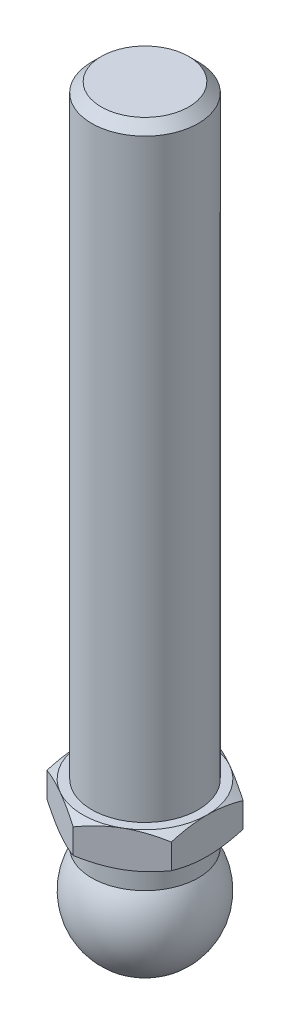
ISO-10303-21;
HEADER;
FILE_DESCRIPTION(('STEP AP214'),'2;1');
FILE_NAME('part.step','',(''),(''),'','','');
FILE_SCHEMA(('AUTOMOTIVE_DESIGN { 1 0 10303 214 1 1 1 1 }'));
ENDSEC;
DATA;
#1=APPLICATION_CONTEXT('core data for automotive mechanical design processes');
#2=APPLICATION_PROTOCOL_DEFINITION('international standard','automotive_design',2000,#1);
#3=PRODUCT_CONTEXT('',#1,'mechanical');
#4=PRODUCT('Part','Part','',(#3));
#5=PRODUCT_RELATED_PRODUCT_CATEGORY('part','',(#4));
#6=PRODUCT_DEFINITION_FORMATION('','',#4);
#7=PRODUCT_DEFINITION_CONTEXT('part definition',#1,'design');
#8=PRODUCT_DEFINITION('design','',#6,#7);
#9=PRODUCT_DEFINITION_SHAPE('','',#8);
#10=(LENGTH_UNIT() NAMED_UNIT(*) SI_UNIT(.MILLI.,.METRE.));
#11=(NAMED_UNIT(*) PLANE_ANGLE_UNIT() SI_UNIT($,.RADIAN.));
#12=(NAMED_UNIT(*) SI_UNIT($,.STERADIAN.) SOLID_ANGLE_UNIT());
#13=UNCERTAINTY_MEASURE_WITH_UNIT(LENGTH_MEASURE(1.E-05),#10,'distance_accuracy_value','');
#14=(GEOMETRIC_REPRESENTATION_CONTEXT(3) GLOBAL_UNCERTAINTY_ASSIGNED_CONTEXT((#13)) GLOBAL_UNIT_ASSIGNED_CONTEXT((#10,
#11,#12)) REPRESENTATION_CONTEXT('',''));
#15=CARTESIAN_POINT('',(0.,0.,0.));
#16=DIRECTION('',(0.,0.,1.));
#17=DIRECTION('',(1.,0.,0.));
#18=AXIS2_PLACEMENT_3D('',#15,#16,#17);
#19=CARTESIAN_POINT('',(0.,10.85,0.));
#20=DIRECTION('',(0.,-1.,0.));
#21=DIRECTION('',(0.,0.,-1.));
#22=AXIS2_PLACEMENT_3D('',#19,#20,#21);
#23=CONICAL_SURFACE('',#22,7.,1.0471975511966);
#24=CARTESIAN_POINT('',(-7.,6.78828268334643,12.1648696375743));
#25=CARTESIAN_POINT('',(-7.,6.93391573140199,11.8738003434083));
#26=CARTESIAN_POINT('',(-7.,7.07854589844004,11.5822239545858));
#27=CARTESIAN_POINT('',(-7.,7.36531569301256,10.997825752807));
#28=CARTESIAN_POINT('',(-7.,7.50745515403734,10.7050038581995));
#29=CARTESIAN_POINT('',(-7.,7.78902214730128,10.117331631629));
#30=CARTESIAN_POINT('',(-7.,7.92844364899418,9.82247840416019));
#31=CARTESIAN_POINT('',(-7.,8.20360604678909,9.2310632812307));
#32=CARTESIAN_POINT('',(-7.,8.33934701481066,8.9345014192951));
#33=CARTESIAN_POINT('',(-7.,8.61231104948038,8.325935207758));
#34=CARTESIAN_POINT('',(-7.,8.74932547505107,8.01383696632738));
#35=CARTESIAN_POINT('',(-7.,9.01713837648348,7.38695797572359));
#36=CARTESIAN_POINT('',(-7.,9.14793657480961,7.07217710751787));
#37=CARTESIAN_POINT('',(-7.,9.40155301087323,6.43962449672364));
#38=CARTESIAN_POINT('',(-7.,9.524376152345,6.12185473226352));
#39=CARTESIAN_POINT('',(-7.,9.7599016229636,5.48260317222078));
#40=CARTESIAN_POINT('',(-7.,9.87260505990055,5.16112178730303));
#41=CARTESIAN_POINT('',(-7.,10.1099014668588,4.43821731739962));
#42=CARTESIAN_POINT('',(-7.,10.231118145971,4.03566892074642));
#43=CARTESIAN_POINT('',(-7.,10.4469740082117,3.22331060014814));
#44=CARTESIAN_POINT('',(-7.,10.5416155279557,2.81350131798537));
#45=CARTESIAN_POINT('',(-7.,10.6569999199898,2.19742561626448));
#46=CARTESIAN_POINT('',(-7.,10.6908518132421,1.99359214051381));
#47=CARTESIAN_POINT('',(-7.,10.7493191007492,1.58461613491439));
#48=CARTESIAN_POINT('',(-7.,10.7739358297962,1.37947379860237));
#49=CARTESIAN_POINT('',(-7.,10.8131968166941,0.968289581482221));
#50=CARTESIAN_POINT('',(-7.,10.8278439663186,0.762247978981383));
#51=CARTESIAN_POINT('',(-7.,10.8467021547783,0.349683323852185));
#52=CARTESIAN_POINT('',(-7.,10.8509132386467,0.143160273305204));
#53=CARTESIAN_POINT('',(-7.,10.8487493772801,-0.27108276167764));
#54=CARTESIAN_POINT('',(-7.,10.8423100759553,-0.478802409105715));
#55=CARTESIAN_POINT('',(-7.,10.8189433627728,-0.893645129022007));
#56=CARTESIAN_POINT('',(-7.,10.8020159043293,-1.10076819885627));
#57=CARTESIAN_POINT('',(-7.,10.7582124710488,-1.51403043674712));
#58=CARTESIAN_POINT('',(-7.,10.7313327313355,-1.7201692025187));
#59=CARTESIAN_POINT('',(-7.,10.6684180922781,-2.13103319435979));
#60=CARTESIAN_POINT('',(-7.,10.6323828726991,-2.33575837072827));
#61=CARTESIAN_POINT('',(-7.,10.5105686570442,-2.95437912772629));
#62=CARTESIAN_POINT('',(-7.,10.4118729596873,-3.36575077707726));
#63=CARTESIAN_POINT('',(-7.,10.1884533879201,-4.18138012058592));
#64=CARTESIAN_POINT('',(-7.,10.0637148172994,-4.58563365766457));
#65=CARTESIAN_POINT('',(-7.,9.82332483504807,-5.30320893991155));
#66=CARTESIAN_POINT('',(-7.,9.71128759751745,-5.61775957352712));
#67=CARTESIAN_POINT('',(-7.,9.47785144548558,-6.24325021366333));
#68=CARTESIAN_POINT('',(-7.,9.35645511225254,-6.55419118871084));
#69=CARTESIAN_POINT('',(-7.,9.1062070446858,-7.17328528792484));
#70=CARTESIAN_POINT('',(-7.,8.97735033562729,-7.48143638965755));
#71=CARTESIAN_POINT('',(-7.,8.71378231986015,-8.09523802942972));
#72=CARTESIAN_POINT('',(-7.,8.57907065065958,-8.40088841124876));
#73=CARTESIAN_POINT('',(-7.,8.31078407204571,-8.99716345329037));
#74=CARTESIAN_POINT('',(-7.,8.17740317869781,-9.28787568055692));
#75=CARTESIAN_POINT('',(-7.,7.90714715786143,-9.86766295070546));
#76=CARTESIAN_POINT('',(-7.,7.77027208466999,-10.1567380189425));
#77=CARTESIAN_POINT('',(-7.,7.49389786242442,-10.7329937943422));
#78=CARTESIAN_POINT('',(-7.,7.35440383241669,-11.0201769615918));
#79=CARTESIAN_POINT('',(-7.,7.07302286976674,-11.5933594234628));
#80=CARTESIAN_POINT('',(-7.,6.93113600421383,-11.879358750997));
#81=CARTESIAN_POINT('',(-7.,6.78828268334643,-12.1648696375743));
#82=B_SPLINE_CURVE_WITH_KNOTS('',3,(#24,#25,#26,#27,#28,#29,#30,#31,#32,#33,#34,#35,#36,#37,#38,
#39,#40,#41,#42,#43,#44,#45,#46,#47,#48,#49,#50,#51,#52,#53,#54,#55,#56,#57,#58,#59,#60,#61,#62,
#63,#64,#65,#66,#67,#68,#69,#70,#71,#72,#73,#74,#75,#76,#77,#78,#79,#80,#81),.UNSPECIFIED.,.F.,
.F.,(4,2,2,2,2,2,2,2,2,2,2,2,2,2,2,2,2,2,2,2,2,2,2,2,2,2,2,2,4),(0.,0.976413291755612,
1.95289161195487,2.93133423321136,3.90975772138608,4.93225217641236,5.95479223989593,
6.9766974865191,7.9984907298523,9.25906449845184,10.5195273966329,11.1392271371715,
11.7588372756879,12.3782676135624,12.9976952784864,13.6208795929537,14.2440666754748,
14.8674897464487,15.490934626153,16.758797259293,18.027377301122,19.0289263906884,
20.0302002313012,21.0321496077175,22.0341611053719,22.9936838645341,23.9531917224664,
24.9109871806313,25.8687558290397),.UNSPECIFIED.);
#83=CARTESIAN_POINT('',(-7.,10.2247852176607,4.04145188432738));
#84=VERTEX_POINT('',#83);
#85=CARTESIAN_POINT('',(-7.,10.85,0.));
#86=VERTEX_POINT('',#85);
#87=EDGE_CURVE('E316',#84,#86,#82,.T.);
#88=ORIENTED_EDGE('',*,*,#87,.F.);
#89=CARTESIAN_POINT('',(0.00020000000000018,10.2247185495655,8.0830192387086));
#90=CARTESIAN_POINT('',(-0.153667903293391,10.2760001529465,7.99418356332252));
#91=CARTESIAN_POINT('',(-0.30810950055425,10.3249544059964,7.90501666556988));
#92=CARTESIAN_POINT('',(-0.618246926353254,10.4175672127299,7.72595873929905));
#93=CARTESIAN_POINT('',(-0.773943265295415,10.4612234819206,7.63606741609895));
#94=CARTESIAN_POINT('',(-1.24352516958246,10.5833884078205,7.36495417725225));
#95=CARTESIAN_POINT('',(-1.5592643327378,10.652874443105,7.18266208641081));
#96=CARTESIAN_POINT('',(-2.03176224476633,10.7343550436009,6.9098652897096));
#97=CARTESIAN_POINT('',(-2.18710922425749,10.7575665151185,6.82017566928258));
#98=CARTESIAN_POINT('',(-2.49850511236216,10.7964887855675,6.64039116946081));
#99=CARTESIAN_POINT('',(-2.65455395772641,10.8122002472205,6.55029632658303));
#100=CARTESIAN_POINT('',(-2.96692267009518,10.8357220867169,6.36995016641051));
#101=CARTESIAN_POINT('',(-3.12324202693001,10.8435414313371,6.27969914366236));
#102=CARTESIAN_POINT('',(-3.43601650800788,10.8511197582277,6.09911871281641));
#103=CARTESIAN_POINT('',(-3.59247162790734,10.850878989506,6.00878930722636));
#104=CARTESIAN_POINT('',(-4.02110687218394,10.8391402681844,5.76131663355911));
#105=CARTESIAN_POINT('',(-4.2931466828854,10.8194342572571,5.60425437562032));
#106=CARTESIAN_POINT('',(-4.8354194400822,10.7569465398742,5.29117305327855));
#107=CARTESIAN_POINT('',(-5.10565047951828,10.714143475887,5.13515508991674));
#108=CARTESIAN_POINT('',(-5.64901454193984,10.6071483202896,4.82144370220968));
#109=CARTESIAN_POINT('',(-5.92207900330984,10.5425029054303,4.66378986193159));
#110=CARTESIAN_POINT('',(-6.46413578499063,10.395783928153,4.35083323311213));
#111=CARTESIAN_POINT('',(-6.73313504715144,10.3137448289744,4.19552643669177));
#112=CARTESIAN_POINT('',(-7.0002,10.2247185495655,4.04133641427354));
#113=B_SPLINE_CURVE_WITH_KNOTS('',3,(#89,#90,#91,#92,#93,#94,#95,#96,#97,#98,#99,#100,#101,#102,
#103,#104,#105,#106,#107,#108,#109,#110,#111,#112),.UNSPECIFIED.,.F.,.F.,(4,2,2,2,2,2,2,2,2,2,2,
4),(0.,0.554727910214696,1.10969417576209,2.2219327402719,2.76443041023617,3.30688013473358,
3.8487128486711,4.3905288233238,5.33376515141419,6.27787517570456,7.2429241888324,
8.20607866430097),.UNSPECIFIED.);
#114=CARTESIAN_POINT('',(-3.5,10.85,6.06217782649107));
#115=VERTEX_POINT('',#114);
#116=EDGE_CURVE('E138',#115,#84,#113,.T.);
#117=ORIENTED_EDGE('',*,*,#116,.F.);
#118=CARTESIAN_POINT('',(0.,10.85,0.));
#119=DIRECTION('',(0.,-1.,0.));
#120=DIRECTION('',(0.,0.,-1.));
#121=AXIS2_PLACEMENT_3D('',#118,#119,#120);
#122=CIRCLE('',#121,7.);
#123=EDGE_CURVE('E286',#115,#86,#122,.T.);
#124=ORIENTED_EDGE('',*,*,#123,.T.);
#125=EDGE_LOOP('',(#88,#117,#124));
#126=FACE_BOUND('',#125,.T.);
#127=ADVANCED_FACE('F17',(#126),#23,.T.);
#128=CARTESIAN_POINT('',(-7.,10.2247852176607,-4.04145188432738));
#129=VERTEX_POINT('',#128);
#130=EDGE_CURVE('E196',#86,#129,#82,.T.);
#131=ORIENTED_EDGE('',*,*,#130,.F.);
#132=CARTESIAN_POINT('',(-3.5,10.85,-6.06217782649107));
#133=VERTEX_POINT('',#132);
#134=EDGE_CURVE('E198',#86,#133,#122,.T.);
#135=ORIENTED_EDGE('',*,*,#134,.T.);
#136=CARTESIAN_POINT('',(-7.0002,10.2247185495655,-4.04133641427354));
#137=CARTESIAN_POINT('',(-6.84633209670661,10.2760001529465,-4.13017208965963));
#138=CARTESIAN_POINT('',(-6.69189049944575,10.3249544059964,-4.21933898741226));
#139=CARTESIAN_POINT('',(-6.38175307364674,10.4175672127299,-4.39839691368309));
#140=CARTESIAN_POINT('',(-6.22605673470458,10.4612234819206,-4.48828823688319));
#141=CARTESIAN_POINT('',(-5.75647483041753,10.5833884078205,-4.75940147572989));
#142=CARTESIAN_POINT('',(-5.4407356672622,10.652874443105,-4.94169356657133));
#143=CARTESIAN_POINT('',(-4.96823775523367,10.7343550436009,-5.21449036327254));
#144=CARTESIAN_POINT('',(-4.81289077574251,10.7575665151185,-5.30417998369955));
#145=CARTESIAN_POINT('',(-4.50149488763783,10.7964887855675,-5.48396448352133));
#146=CARTESIAN_POINT('',(-4.34544604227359,10.8122002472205,-5.57405932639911));
#147=CARTESIAN_POINT('',(-4.03307732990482,10.8357220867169,-5.75440548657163));
#148=CARTESIAN_POINT('',(-3.87675797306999,10.8435414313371,-5.84465650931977));
#149=CARTESIAN_POINT('',(-3.56398349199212,10.8511197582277,-6.02523694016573));
#150=CARTESIAN_POINT('',(-3.40752837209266,10.850878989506,-6.11556634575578));
#151=CARTESIAN_POINT('',(-2.97889312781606,10.8391402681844,-6.36303901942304));
#152=CARTESIAN_POINT('',(-2.7068533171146,10.8194342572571,-6.52010127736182));
#153=CARTESIAN_POINT('',(-2.1645805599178,10.7569465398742,-6.83318259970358));
#154=CARTESIAN_POINT('',(-1.89434952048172,10.714143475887,-6.9892005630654));
#155=CARTESIAN_POINT('',(-1.35098545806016,10.6071483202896,-7.30291195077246));
#156=CARTESIAN_POINT('',(-1.07792099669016,10.5425029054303,-7.46056579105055));
#157=CARTESIAN_POINT('',(-0.53586421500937,10.395783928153,-7.77352241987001));
#158=CARTESIAN_POINT('',(-0.266864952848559,10.3137448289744,-7.92882921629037));
#159=CARTESIAN_POINT('',(0.000200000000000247,10.2247185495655,-8.0830192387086));
#160=B_SPLINE_CURVE_WITH_KNOTS('',3,(#136,#137,#138,#139,#140,#141,#142,#143,#144,#145,#146,
#147,#148,#149,#150,#151,#152,#153,#154,#155,#156,#157,#158,#159),.UNSPECIFIED.,.F.,.F.,(4,2,2,
2,2,2,2,2,2,2,2,4),(0.,0.554727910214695,1.10969417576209,2.2219327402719,2.76443041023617,
3.30688013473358,3.8487128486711,4.39052882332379,5.33376515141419,6.27787517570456,
7.2429241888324,8.20607866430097),.UNSPECIFIED.);
#161=EDGE_CURVE('E186',#129,#133,#160,.T.);
#162=ORIENTED_EDGE('',*,*,#161,.F.);
#163=EDGE_LOOP('',(#131,#135,#162));
#164=FACE_BOUND('',#163,.T.);
#165=ADVANCED_FACE('F195',(#164),#23,.T.);
#166=CARTESIAN_POINT('',(0.,10.2247852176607,-8.08290376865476));
#167=VERTEX_POINT('',#166);
#168=EDGE_CURVE('E200',#133,#167,#160,.T.);
#169=ORIENTED_EDGE('',*,*,#168,.F.);
#170=CARTESIAN_POINT('',(3.5,10.85,-6.06217782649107));
#171=VERTEX_POINT('',#170);
#172=EDGE_CURVE('E296',#133,#171,#122,.T.);
#173=ORIENTED_EDGE('',*,*,#172,.T.);
#174=CARTESIAN_POINT('',(-0.00020000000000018,10.2247185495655,-8.0830192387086));
#175=CARTESIAN_POINT('',(0.153667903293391,10.2760001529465,-7.99418356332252));
#176=CARTESIAN_POINT('',(0.30810950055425,10.3249544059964,-7.90501666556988));
#177=CARTESIAN_POINT('',(0.618246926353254,10.4175672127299,-7.72595873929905));
#178=CARTESIAN_POINT('',(0.773943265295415,10.4612234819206,-7.63606741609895));
#179=CARTESIAN_POINT('',(1.24352516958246,10.5833884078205,-7.36495417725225));
#180=CARTESIAN_POINT('',(1.5592643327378,10.652874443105,-7.18266208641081));
#181=CARTESIAN_POINT('',(2.03176224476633,10.7343550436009,-6.9098652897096));
#182=CARTESIAN_POINT('',(2.18710922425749,10.7575665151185,-6.82017566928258));
#183=CARTESIAN_POINT('',(2.49850511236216,10.7964887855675,-6.64039116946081));
#184=CARTESIAN_POINT('',(2.65455395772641,10.8122002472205,-6.55029632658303));
#185=CARTESIAN_POINT('',(2.96692267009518,10.8357220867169,-6.36995016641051));
#186=CARTESIAN_POINT('',(3.12324202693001,10.8435414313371,-6.27969914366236));
#187=CARTESIAN_POINT('',(3.43601650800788,10.8511197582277,-6.09911871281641));
#188=CARTESIAN_POINT('',(3.59247162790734,10.850878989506,-6.00878930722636));
#189=CARTESIAN_POINT('',(4.02110687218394,10.8391402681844,-5.76131663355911));
#190=CARTESIAN_POINT('',(4.2931466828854,10.8194342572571,-5.60425437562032));
#191=CARTESIAN_POINT('',(4.8354194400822,10.7569465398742,-5.29117305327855));
#192=CARTESIAN_POINT('',(5.10565047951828,10.714143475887,-5.13515508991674));
#193=CARTESIAN_POINT('',(5.64901454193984,10.6071483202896,-4.82144370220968));
#194=CARTESIAN_POINT('',(5.92207900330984,10.5425029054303,-4.66378986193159));
#195=CARTESIAN_POINT('',(6.46413578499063,10.395783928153,-4.35083323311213));
#196=CARTESIAN_POINT('',(6.73313504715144,10.3137448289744,-4.19552643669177));
#197=CARTESIAN_POINT('',(7.0002,10.2247185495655,-4.04133641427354));
#198=B_SPLINE_CURVE_WITH_KNOTS('',3,(#174,#175,#176,#177,#178,#179,#180,#181,#182,#183,#184,
#185,#186,#187,#188,#189,#190,#191,#192,#193,#194,#195,#196,#197),.UNSPECIFIED.,.F.,.F.,(4,2,2,
2,2,2,2,2,2,2,2,4),(0.,0.554727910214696,1.10969417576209,2.2219327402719,2.76443041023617,
3.30688013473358,3.8487128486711,4.3905288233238,5.33376515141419,6.27787517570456,
7.2429241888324,8.20607866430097),.UNSPECIFIED.);
#199=EDGE_CURVE('E246',#167,#171,#198,.T.);
#200=ORIENTED_EDGE('',*,*,#199,.F.);
#201=EDGE_LOOP('',(#169,#173,#200));
#202=FACE_BOUND('',#201,.T.);
#203=ADVANCED_FACE('F349',(#202),#23,.T.);
#204=CARTESIAN_POINT('',(7.,10.2247852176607,-4.04145188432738));
#205=VERTEX_POINT('',#204);
#206=EDGE_CURVE('E241',#171,#205,#198,.T.);
#207=ORIENTED_EDGE('',*,*,#206,.F.);
#208=CARTESIAN_POINT('',(7.,10.85,0.));
#209=VERTEX_POINT('',#208);
#210=EDGE_CURVE('E291',#171,#209,#122,.T.);
#211=ORIENTED_EDGE('',*,*,#210,.T.);
#212=CARTESIAN_POINT('',(7.,6.78828268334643,-12.1648696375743));
#213=CARTESIAN_POINT('',(7.,6.93391573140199,-11.8738003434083));
#214=CARTESIAN_POINT('',(7.,7.07854589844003,-11.5822239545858));
#215=CARTESIAN_POINT('',(7.,7.36531569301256,-10.997825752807));
#216=CARTESIAN_POINT('',(7.,7.50745515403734,-10.7050038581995));
#217=CARTESIAN_POINT('',(7.,7.78902214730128,-10.117331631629));
#218=CARTESIAN_POINT('',(7.,7.92844364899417,-9.82247840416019));
#219=CARTESIAN_POINT('',(7.,8.20360604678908,-9.23106328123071));
#220=CARTESIAN_POINT('',(7.,8.33934701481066,-8.9345014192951));
#221=CARTESIAN_POINT('',(7.,8.61231104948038,-8.325935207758));
#222=CARTESIAN_POINT('',(7.,8.74932547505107,-8.01383696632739));
#223=CARTESIAN_POINT('',(7.,9.01713837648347,-7.3869579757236));
#224=CARTESIAN_POINT('',(7.,9.1479365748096,-7.07217710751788));
#225=CARTESIAN_POINT('',(7.,9.40155301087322,-6.43962449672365));
#226=CARTESIAN_POINT('',(7.,9.52437615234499,-6.12185473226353));
#227=CARTESIAN_POINT('',(7.,9.7599016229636,-5.48260317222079));
#228=CARTESIAN_POINT('',(7.,9.87260505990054,-5.16112178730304));
#229=CARTESIAN_POINT('',(7.,10.1099014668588,-4.43821731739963));
#230=CARTESIAN_POINT('',(7.,10.231118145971,-4.03566892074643));
#231=CARTESIAN_POINT('',(7.,10.4469740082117,-3.22331060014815));
#232=CARTESIAN_POINT('',(7.,10.5416155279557,-2.81350131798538));
#233=CARTESIAN_POINT('',(7.,10.6569999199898,-2.19742561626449));
#234=CARTESIAN_POINT('',(7.,10.6908518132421,-1.99359214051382));
#235=CARTESIAN_POINT('',(7.,10.7493191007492,-1.5846161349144));
#236=CARTESIAN_POINT('',(7.,10.7739358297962,-1.37947379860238));
#237=CARTESIAN_POINT('',(7.,10.8131968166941,-0.968289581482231));
#238=CARTESIAN_POINT('',(7.,10.8278439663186,-0.762247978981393));
#239=CARTESIAN_POINT('',(7.,10.8467021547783,-0.349683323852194));
#240=CARTESIAN_POINT('',(7.,10.8509132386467,-0.143160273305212));
#241=CARTESIAN_POINT('',(7.,10.8487493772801,0.271082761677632));
#242=CARTESIAN_POINT('',(7.,10.8423100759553,0.478802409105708));
#243=CARTESIAN_POINT('',(7.,10.8189433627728,0.893645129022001));
#244=CARTESIAN_POINT('',(7.,10.8020159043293,1.10076819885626));
#245=CARTESIAN_POINT('',(7.,10.7582124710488,1.51403043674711));
#246=CARTESIAN_POINT('',(7.,10.7313327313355,1.72016920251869));
#247=CARTESIAN_POINT('',(7.,10.6684180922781,2.13103319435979));
#248=CARTESIAN_POINT('',(7.,10.6323828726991,2.33575837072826));
#249=CARTESIAN_POINT('',(7.,10.5105686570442,2.95437912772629));
#250=CARTESIAN_POINT('',(7.,10.4118729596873,3.36575077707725));
#251=CARTESIAN_POINT('',(7.,10.1884533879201,4.18138012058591));
#252=CARTESIAN_POINT('',(7.,10.0637148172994,4.58563365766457));
#253=CARTESIAN_POINT('',(7.,9.82332483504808,5.30320893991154));
#254=CARTESIAN_POINT('',(7.,9.71128759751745,5.61775957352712));
#255=CARTESIAN_POINT('',(7.,9.47785144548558,6.24325021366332));
#256=CARTESIAN_POINT('',(7.,9.35645511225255,6.55419118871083));
#257=CARTESIAN_POINT('',(7.,9.1062070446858,7.17328528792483));
#258=CARTESIAN_POINT('',(7.,8.9773503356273,7.48143638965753));
#259=CARTESIAN_POINT('',(7.,8.71378231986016,8.09523802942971));
#260=CARTESIAN_POINT('',(7.,8.57907065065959,8.40088841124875));
#261=CARTESIAN_POINT('',(7.,8.31078407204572,8.99716345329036));
#262=CARTESIAN_POINT('',(7.,8.17740317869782,9.2878756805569));
#263=CARTESIAN_POINT('',(7.,7.90714715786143,9.86766295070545));
#264=CARTESIAN_POINT('',(7.,7.77027208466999,10.1567380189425));
#265=CARTESIAN_POINT('',(7.,7.49389786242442,10.7329937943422));
#266=CARTESIAN_POINT('',(7.,7.35440383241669,11.0201769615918));
#267=CARTESIAN_POINT('',(7.,7.07302286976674,11.5933594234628));
#268=CARTESIAN_POINT('',(7.,6.93113600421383,11.879358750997));
#269=CARTESIAN_POINT('',(7.,6.78828268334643,12.1648696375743));
#270=B_SPLINE_CURVE_WITH_KNOTS('',3,(#212,#213,#214,#215,#216,#217,#218,#219,#220,#221,#222,
#223,#224,#225,#226,#227,#228,#229,#230,#231,#232,#233,#234,#235,#236,#237,#238,#239,#240,#241,
#242,#243,#244,#245,#246,#247,#248,#249,#250,#251,#252,#253,#254,#255,#256,#257,#258,#259,#260,
#261,#262,#263,#264,#265,#266,#267,#268,#269),.UNSPECIFIED.,.F.,.F.,(4,2,2,2,2,2,2,2,2,2,2,2,2,
2,2,2,2,2,2,2,2,2,2,2,2,2,2,2,4),(0.,0.976413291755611,1.95289161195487,2.93133423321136,
3.90975772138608,4.93225217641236,5.95479223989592,6.97669748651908,7.99849072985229,
9.25906449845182,10.5195273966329,11.1392271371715,11.7588372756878,12.3782676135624,
12.9976952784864,13.6208795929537,14.2440666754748,14.8674897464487,15.490934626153,
16.758797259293,18.027377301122,19.0289263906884,20.0302002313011,21.0321496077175,
22.0341611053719,22.9936838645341,23.9531917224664,24.9109871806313,25.8687558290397),.UNSPECIFIED.);
#271=EDGE_CURVE('E252',#205,#209,#270,.T.);
#272=ORIENTED_EDGE('',*,*,#271,.F.);
#273=EDGE_LOOP('',(#207,#211,#272));
#274=FACE_BOUND('',#273,.T.);
#275=ADVANCED_FACE('F359',(#274),#23,.T.);
#276=CARTESIAN_POINT('',(7.,10.2247852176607,4.04145188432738));
#277=VERTEX_POINT('',#276);
#278=EDGE_CURVE('E254',#209,#277,#270,.T.);
#279=ORIENTED_EDGE('',*,*,#278,.F.);
#280=CARTESIAN_POINT('',(3.5,10.85,6.06217782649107));
#281=VERTEX_POINT('',#280);
#282=EDGE_CURVE('E284',#209,#281,#122,.T.);
#283=ORIENTED_EDGE('',*,*,#282,.T.);
#284=CARTESIAN_POINT('',(7.0002,10.2247185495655,4.04133641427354));
#285=CARTESIAN_POINT('',(6.84633209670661,10.2760001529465,4.13017208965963));
#286=CARTESIAN_POINT('',(6.69189049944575,10.3249544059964,4.21933898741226));
#287=CARTESIAN_POINT('',(6.38175307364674,10.4175672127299,4.39839691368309));
#288=CARTESIAN_POINT('',(6.22605673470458,10.4612234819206,4.48828823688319));
#289=CARTESIAN_POINT('',(5.75647483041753,10.5833884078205,4.75940147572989));
#290=CARTESIAN_POINT('',(5.4407356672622,10.652874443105,4.94169356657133));
#291=CARTESIAN_POINT('',(4.96823775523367,10.7343550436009,5.21449036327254));
#292=CARTESIAN_POINT('',(4.81289077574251,10.7575665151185,5.30417998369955));
#293=CARTESIAN_POINT('',(4.50149488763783,10.7964887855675,5.48396448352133));
#294=CARTESIAN_POINT('',(4.34544604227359,10.8122002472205,5.57405932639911));
#295=CARTESIAN_POINT('',(4.03307732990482,10.8357220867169,5.75440548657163));
#296=CARTESIAN_POINT('',(3.87675797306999,10.8435414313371,5.84465650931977));
#297=CARTESIAN_POINT('',(3.56398349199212,10.8511197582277,6.02523694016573));
#298=CARTESIAN_POINT('',(3.40752837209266,10.850878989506,6.11556634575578));
#299=CARTESIAN_POINT('',(2.97889312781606,10.8391402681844,6.36303901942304));
#300=CARTESIAN_POINT('',(2.7068533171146,10.8194342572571,6.52010127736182));
#301=CARTESIAN_POINT('',(2.1645805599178,10.7569465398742,6.83318259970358));
#302=CARTESIAN_POINT('',(1.89434952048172,10.714143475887,6.9892005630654));
#303=CARTESIAN_POINT('',(1.35098545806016,10.6071483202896,7.30291195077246));
#304=CARTESIAN_POINT('',(1.07792099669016,10.5425029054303,7.46056579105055));
#305=CARTESIAN_POINT('',(0.53586421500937,10.395783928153,7.77352241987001));
#306=CARTESIAN_POINT('',(0.266864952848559,10.3137448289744,7.92882921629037));
#307=CARTESIAN_POINT('',(-0.000200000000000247,10.2247185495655,8.0830192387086));
#308=B_SPLINE_CURVE_WITH_KNOTS('',3,(#284,#285,#286,#287,#288,#289,#290,#291,#292,#293,#294,
#295,#296,#297,#298,#299,#300,#301,#302,#303,#304,#305,#306,#307),.UNSPECIFIED.,.F.,.F.,(4,2,2,
2,2,2,2,2,2,2,2,4),(0.,0.554727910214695,1.10969417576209,2.2219327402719,2.76443041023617,
3.30688013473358,3.8487128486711,4.39052882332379,5.33376515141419,6.27787517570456,
7.2429241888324,8.20607866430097),.UNSPECIFIED.);
#309=EDGE_CURVE('E129',#277,#281,#308,.T.);
#310=ORIENTED_EDGE('',*,*,#309,.F.);
#311=EDGE_LOOP('',(#279,#283,#310));
#312=FACE_BOUND('',#311,.T.);
#313=ADVANCED_FACE('F288',(#312),#23,.T.);
#314=CARTESIAN_POINT('',(0.,10.2247852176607,8.08290376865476));
#315=VERTEX_POINT('',#314);
#316=EDGE_CURVE('E119',#281,#315,#308,.T.);
#317=ORIENTED_EDGE('',*,*,#316,.F.);
#318=EDGE_CURVE('E277',#281,#115,#122,.T.);
#319=ORIENTED_EDGE('',*,*,#318,.T.);
#320=EDGE_CURVE('E32',#315,#115,#113,.T.);
#321=ORIENTED_EDGE('',*,*,#320,.F.);
#322=EDGE_LOOP('',(#317,#319,#321));
#323=FACE_BOUND('',#322,.T.);
#324=ADVANCED_FACE('F276',(#323),#23,.T.);
#325=CARTESIAN_POINT('',(0.,78.85,0.));
#326=DIRECTION('',(0.,-1.,0.));
#327=DIRECTION('',(0.,0.,-1.));
#328=AXIS2_PLACEMENT_3D('',#325,#326,#327);
#329=PLANE('',#328);
#330=CARTESIAN_POINT('',(0.,78.85,0.));
#331=DIRECTION('',(0.,-1.,0.));
#332=DIRECTION('',(0.,0.,-1.));
#333=AXIS2_PLACEMENT_3D('',#330,#331,#332);
#334=CIRCLE('',#333,4.9265);
#335=CARTESIAN_POINT('',(0.,78.85,-4.9265));
#336=VERTEX_POINT('',#335);
#337=EDGE_CURVE('E25',#336,#336,#334,.T.);
#338=ORIENTED_EDGE('',*,*,#337,.F.);
#339=EDGE_LOOP('',(#338));
#340=FACE_BOUND('',#339,.T.);
#341=ADVANCED_FACE('F19',(#340),#329,.F.);
#342=CARTESIAN_POINT('',(0.,78.85,0.));
#343=DIRECTION('',(0.,-1.,0.));
#344=DIRECTION('',(0.,0.,-1.));
#345=AXIS2_PLACEMENT_3D('',#342,#343,#344);
#346=CONICAL_SURFACE('',#345,4.9265,0.785398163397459);
#347=CARTESIAN_POINT('',(0.,77.7765,0.));
#348=DIRECTION('',(0.,-1.,0.));
#349=DIRECTION('',(0.,0.,-1.));
#350=AXIS2_PLACEMENT_3D('',#347,#348,#349);
#351=CIRCLE('',#350,6.);
#352=CARTESIAN_POINT('',(0.,77.7765,-6.));
#353=VERTEX_POINT('',#352);
#354=EDGE_CURVE('E293',#353,#353,#351,.T.);
#355=ORIENTED_EDGE('',*,*,#354,.F.);
#356=EDGE_LOOP('',(#355));
#357=FACE_BOUND('',#356,.T.);
#358=ORIENTED_EDGE('',*,*,#337,.T.);
#359=EDGE_LOOP('',(#358));
#360=FACE_BOUND('',#359,.T.);
#361=ADVANCED_FACE('F357',(#357,#360),#346,.T.);
#362=CARTESIAN_POINT('',(0.,-7.,0.));
#363=DIRECTION('',(0.,-1.,0.));
#364=DIRECTION('',(0.,0.,-1.));
#365=AXIS2_PLACEMENT_3D('',#362,#363,#364);
#366=CYLINDRICAL_SURFACE('',#365,6.);
#367=CARTESIAN_POINT('',(0.,10.85,0.));
#368=DIRECTION('',(0.,-1.,0.));
#369=DIRECTION('',(0.,0.,-1.));
#370=AXIS2_PLACEMENT_3D('',#367,#368,#369);
#371=CIRCLE('',#370,6.);
#372=CARTESIAN_POINT('',(0.,10.85,-6.));
#373=VERTEX_POINT('',#372);
#374=EDGE_CURVE('E290',#373,#373,#371,.T.);
#375=ORIENTED_EDGE('',*,*,#374,.F.);
#376=EDGE_LOOP('',(#375));
#377=FACE_BOUND('',#376,.T.);
#378=ORIENTED_EDGE('',*,*,#354,.T.);
#379=EDGE_LOOP('',(#378));
#380=FACE_BOUND('',#379,.T.);
#381=ADVANCED_FACE('F442',(#377,#380),#366,.T.);
#382=CARTESIAN_POINT('',(6.,10.85,0.));
#383=DIRECTION('',(0.,-1.,0.));
#384=DIRECTION('',(0.,0.,-1.));
#385=AXIS2_PLACEMENT_3D('',#382,#383,#384);
#386=PLANE('',#385);
#387=ORIENTED_EDGE('',*,*,#282,.F.);
#388=ORIENTED_EDGE('',*,*,#210,.F.);
#389=ORIENTED_EDGE('',*,*,#172,.F.);
#390=ORIENTED_EDGE('',*,*,#134,.F.);
#391=ORIENTED_EDGE('',*,*,#123,.F.);
#392=ORIENTED_EDGE('',*,*,#318,.F.);
#393=EDGE_LOOP('',(#387,#388,#389,#390,#391,#392));
#394=FACE_BOUND('',#393,.T.);
#395=ORIENTED_EDGE('',*,*,#374,.T.);
#396=EDGE_LOOP('',(#395));
#397=FACE_BOUND('',#396,.T.);
#398=ADVANCED_FACE('F281',(#394,#397),#386,.F.);
#399=CARTESIAN_POINT('',(-7.,6.8,-4.04145188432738));
#400=DIRECTION('',(-1.,0.,0.));
#401=DIRECTION('',(0.,0.,1.));
#402=AXIS2_PLACEMENT_3D('',#399,#400,#401);
#403=PLANE('',#402);
#404=ORIENTED_EDGE('',*,*,#87,.T.);
#405=ORIENTED_EDGE('',*,*,#130,.T.);
#406=DIRECTION('',(0.,1.,0.));
#407=VECTOR('',#406,1.);
#408=CARTESIAN_POINT('',(-7.,6.8,-4.04145188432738));
#409=LINE('',#408,#407);
#410=CARTESIAN_POINT('',(-7.,7.4252147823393,-4.04145188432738));
#411=VERTEX_POINT('',#410);
#412=EDGE_CURVE('E112',#411,#129,#409,.T.);
#413=ORIENTED_EDGE('',*,*,#412,.F.);
#414=CARTESIAN_POINT('',(-7.,10.8617173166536,-12.1648696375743));
#415=CARTESIAN_POINT('',(-7.,10.716084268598,-11.8738003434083));
#416=CARTESIAN_POINT('',(-7.,10.57145410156,-11.5822239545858));
#417=CARTESIAN_POINT('',(-7.,10.2846843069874,-10.997825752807));
#418=CARTESIAN_POINT('',(-7.,10.1425448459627,-10.7050038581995));
#419=CARTESIAN_POINT('',(-7.,9.86097785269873,-10.1173316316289));
#420=CARTESIAN_POINT('',(-7.,9.72155635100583,-9.82247840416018));
#421=CARTESIAN_POINT('',(-7.,9.44639395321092,-9.23106328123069));
#422=CARTESIAN_POINT('',(-7.,9.31065298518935,-8.93450141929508));
#423=CARTESIAN_POINT('',(-7.,9.03768895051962,-8.32593520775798));
#424=CARTESIAN_POINT('',(-7.,8.90067452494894,-8.01383696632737));
#425=CARTESIAN_POINT('',(-7.,8.63286162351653,-7.38695797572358));
#426=CARTESIAN_POINT('',(-7.,8.5020634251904,-7.07217710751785));
#427=CARTESIAN_POINT('',(-7.,8.24844698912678,-6.43962449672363));
#428=CARTESIAN_POINT('',(-7.,8.12562384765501,-6.12185473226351));
#429=CARTESIAN_POINT('',(-7.,7.8900983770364,-5.48260317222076));
#430=CARTESIAN_POINT('',(-7.,7.77739494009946,-5.16112178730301));
#431=CARTESIAN_POINT('',(-7.,7.54009853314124,-4.43821731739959));
#432=CARTESIAN_POINT('',(-7.,7.41888185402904,-4.03566892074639));
#433=CARTESIAN_POINT('',(-7.,7.20302599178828,-3.22331060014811));
#434=CARTESIAN_POINT('',(-7.,7.10838447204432,-2.81350131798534));
#435=CARTESIAN_POINT('',(-7.,6.99300008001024,-2.19742561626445));
#436=CARTESIAN_POINT('',(-7.,6.95914818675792,-1.99359214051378));
#437=CARTESIAN_POINT('',(-7.,6.90068089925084,-1.58461613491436));
#438=CARTESIAN_POINT('',(-7.,6.87606417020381,-1.37947379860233));
#439=CARTESIAN_POINT('',(-7.,6.83680318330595,-0.968289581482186));
#440=CARTESIAN_POINT('',(-7.,6.82215603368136,-0.762247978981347));
#441=CARTESIAN_POINT('',(-7.,6.80329784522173,-0.349683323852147));
#442=CARTESIAN_POINT('',(-7.,6.79908676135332,-0.143160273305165));
#443=CARTESIAN_POINT('',(-7.,6.80125062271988,0.27108276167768));
#444=CARTESIAN_POINT('',(-7.,6.80768992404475,0.478802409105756));
#445=CARTESIAN_POINT('',(-7.,6.83105663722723,0.89364512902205));
#446=CARTESIAN_POINT('',(-7.,6.84798409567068,1.10076819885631));
#447=CARTESIAN_POINT('',(-7.,6.89178752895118,1.51403043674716));
#448=CARTESIAN_POINT('',(-7.,6.91866726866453,1.72016920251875));
#449=CARTESIAN_POINT('',(-7.,6.9815819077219,2.13103319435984));
#450=CARTESIAN_POINT('',(-7.,7.01761712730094,2.33575837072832));
#451=CARTESIAN_POINT('',(-7.,7.13943134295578,2.95437912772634));
#452=CARTESIAN_POINT('',(-7.,7.23812704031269,3.3657507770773));
#453=CARTESIAN_POINT('',(-7.,7.46154661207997,4.18138012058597));
#454=CARTESIAN_POINT('',(-7.,7.58628518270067,4.58563365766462));
#455=CARTESIAN_POINT('',(-7.,7.82667516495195,5.3032089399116));
#456=CARTESIAN_POINT('',(-7.,7.93871240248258,5.61775957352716));
#457=CARTESIAN_POINT('',(-7.,8.17214855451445,6.24325021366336));
#458=CARTESIAN_POINT('',(-7.,8.29354488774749,6.55419118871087));
#459=CARTESIAN_POINT('',(-7.,8.54379295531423,7.17328528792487));
#460=CARTESIAN_POINT('',(-7.,8.67264966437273,7.48143638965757));
#461=CARTESIAN_POINT('',(-7.,8.93621768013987,8.09523802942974));
#462=CARTESIAN_POINT('',(-7.,9.07092934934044,8.40088841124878));
#463=CARTESIAN_POINT('',(-7.,9.3392159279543,8.99716345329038));
#464=CARTESIAN_POINT('',(-7.,9.4725968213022,9.28787568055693));
#465=CARTESIAN_POINT('',(-7.,9.74285284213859,9.86766295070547));
#466=CARTESIAN_POINT('',(-7.,9.87972791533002,10.1567380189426));
#467=CARTESIAN_POINT('',(-7.,10.1561021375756,10.7329937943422));
#468=CARTESIAN_POINT('',(-7.,10.2955961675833,11.0201769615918));
#469=CARTESIAN_POINT('',(-7.,10.5769771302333,11.5933594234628));
#470=CARTESIAN_POINT('',(-7.,10.7188639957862,11.879358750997));
#471=CARTESIAN_POINT('',(-7.,10.8617173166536,12.1648696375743));
#472=B_SPLINE_CURVE_WITH_KNOTS('',3,(#414,#415,#416,#417,#418,#419,#420,#421,#422,#423,#424,
#425,#426,#427,#428,#429,#430,#431,#432,#433,#434,#435,#436,#437,#438,#439,#440,#441,#442,#443,
#444,#445,#446,#447,#448,#449,#450,#451,#452,#453,#454,#455,#456,#457,#458,#459,#460,#461,#462,
#463,#464,#465,#466,#467,#468,#469,#470,#471),.UNSPECIFIED.,.F.,.F.,(4,2,2,2,2,2,2,2,2,2,2,2,2,
2,2,2,2,2,2,2,2,2,2,2,2,2,2,2,4),(0.,0.976413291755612,1.95289161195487,2.93133423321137,
3.90975772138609,4.93225217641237,5.95479223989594,6.9766974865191,7.99849072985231,
9.25906449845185,10.5195273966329,11.1392271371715,11.7588372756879,12.3782676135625,
12.9976952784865,13.6208795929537,14.2440666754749,14.8674897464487,15.490934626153,
16.758797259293,18.0273773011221,19.0289263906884,20.0302002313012,21.0321496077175,
22.0341611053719,22.9936838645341,23.9531917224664,24.9109871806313,25.8687558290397),.UNSPECIFIED.);
#473=CARTESIAN_POINT('',(-7.,6.8,0.));
#474=VERTEX_POINT('',#473);
#475=EDGE_CURVE('E202',#411,#474,#472,.T.);
#476=ORIENTED_EDGE('',*,*,#475,.T.);
#477=CARTESIAN_POINT('',(-7.,7.4252147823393,4.04145188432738));
#478=VERTEX_POINT('',#477);
#479=EDGE_CURVE('E199',#474,#478,#472,.T.);
#480=ORIENTED_EDGE('',*,*,#479,.T.);
#481=DIRECTION('',(0.,1.,0.));
#482=VECTOR('',#481,1.);
#483=CARTESIAN_POINT('',(-7.,6.8,4.04145188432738));
#484=LINE('',#483,#482);
#485=EDGE_CURVE('E121',#478,#84,#484,.T.);
#486=ORIENTED_EDGE('',*,*,#485,.T.);
#487=EDGE_LOOP('',(#404,#405,#413,#476,#480,#486));
#488=FACE_BOUND('',#487,.T.);
#489=ADVANCED_FACE('F227',(#488),#403,.T.);
#490=CARTESIAN_POINT('',(0.,6.8,-8.08290376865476));
#491=DIRECTION('',(-0.5,0.,-0.866025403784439));
#492=DIRECTION('',(-0.866025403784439,0.,0.5));
#493=AXIS2_PLACEMENT_3D('',#490,#491,#492);
#494=PLANE('',#493);
#495=ORIENTED_EDGE('',*,*,#161,.T.);
#496=ORIENTED_EDGE('',*,*,#168,.T.);
#497=DIRECTION('',(0.,1.,0.));
#498=VECTOR('',#497,1.);
#499=CARTESIAN_POINT('',(0.,6.8,-8.08290376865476));
#500=LINE('',#499,#498);
#501=CARTESIAN_POINT('',(0.,7.4252147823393,-8.08290376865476));
#502=VERTEX_POINT('',#501);
#503=EDGE_CURVE('E178',#502,#167,#500,.T.);
#504=ORIENTED_EDGE('',*,*,#503,.F.);
#505=CARTESIAN_POINT('',(0.000200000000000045,7.42528145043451,-8.0830192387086));
#506=CARTESIAN_POINT('',(-0.153667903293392,7.3739998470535,-7.99418356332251));
#507=CARTESIAN_POINT('',(-0.30810950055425,7.3250455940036,-7.90501666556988));
#508=CARTESIAN_POINT('',(-0.618246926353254,7.23243278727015,-7.72595873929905));
#509=CARTESIAN_POINT('',(-0.773943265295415,7.18877651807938,-7.63606741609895));
#510=CARTESIAN_POINT('',(-1.24352516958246,7.06661159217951,-7.36495417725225));
#511=CARTESIAN_POINT('',(-1.5592643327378,6.99712555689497,-7.18266208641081));
#512=CARTESIAN_POINT('',(-2.03176224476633,6.91564495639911,-6.9098652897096));
#513=CARTESIAN_POINT('',(-2.18710922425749,6.89243348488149,-6.82017566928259));
#514=CARTESIAN_POINT('',(-2.49850511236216,6.85351121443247,-6.64039116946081));
#515=CARTESIAN_POINT('',(-2.65455395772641,6.83779975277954,-6.55029632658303));
#516=CARTESIAN_POINT('',(-2.96692267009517,6.81427791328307,-6.36995016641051));
#517=CARTESIAN_POINT('',(-3.12324202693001,6.80645856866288,-6.27969914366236));
#518=CARTESIAN_POINT('',(-3.43601650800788,6.79888024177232,-6.09911871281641));
#519=CARTESIAN_POINT('',(-3.59247162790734,6.799121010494,-6.00878930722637));
#520=CARTESIAN_POINT('',(-4.02110687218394,6.81085973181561,-5.76131663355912));
#521=CARTESIAN_POINT('',(-4.2931466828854,6.83056574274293,-5.60425437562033));
#522=CARTESIAN_POINT('',(-4.83541944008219,6.89305346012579,-5.29117305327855));
#523=CARTESIAN_POINT('',(-5.10565047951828,6.935856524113,-5.13515508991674));
#524=CARTESIAN_POINT('',(-5.64901454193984,7.04285167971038,-4.82144370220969));
#525=CARTESIAN_POINT('',(-5.92207900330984,7.10749709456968,-4.66378986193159));
#526=CARTESIAN_POINT('',(-6.46413578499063,7.25421607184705,-4.35083323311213));
#527=CARTESIAN_POINT('',(-6.73313504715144,7.33625517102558,-4.19552643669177));
#528=CARTESIAN_POINT('',(-7.0002,7.42528145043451,-4.04133641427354));
#529=B_SPLINE_CURVE_WITH_KNOTS('',3,(#505,#506,#507,#508,#509,#510,#511,#512,#513,#514,#515,
#516,#517,#518,#519,#520,#521,#522,#523,#524,#525,#526,#527,#528),.UNSPECIFIED.,.F.,.F.,(4,2,2,
2,2,2,2,2,2,2,2,4),(0.,0.554727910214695,1.10969417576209,2.2219327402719,2.76443041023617,
3.30688013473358,3.8487128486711,4.39052882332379,5.33376515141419,6.27787517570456,
7.2429241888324,8.20607866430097),.UNSPECIFIED.);
#530=CARTESIAN_POINT('',(-3.5,6.8,-6.06217782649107));
#531=VERTEX_POINT('',#530);
#532=EDGE_CURVE('E204',#502,#531,#529,.T.);
#533=ORIENTED_EDGE('',*,*,#532,.T.);
#534=EDGE_CURVE('E189',#531,#411,#529,.T.);
#535=ORIENTED_EDGE('',*,*,#534,.T.);
#536=ORIENTED_EDGE('',*,*,#412,.T.);
#537=EDGE_LOOP('',(#495,#496,#504,#533,#535,#536));
#538=FACE_BOUND('',#537,.T.);
#539=ADVANCED_FACE('F185',(#538),#494,.T.);
#540=CARTESIAN_POINT('',(7.,6.8,-4.04145188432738));
#541=DIRECTION('',(0.5,0.,-0.866025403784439));
#542=DIRECTION('',(-0.866025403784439,0.,-0.5));
#543=AXIS2_PLACEMENT_3D('',#540,#541,#542);
#544=PLANE('',#543);
#545=ORIENTED_EDGE('',*,*,#199,.T.);
#546=ORIENTED_EDGE('',*,*,#206,.T.);
#547=DIRECTION('',(0.,1.,0.));
#548=VECTOR('',#547,1.);
#549=CARTESIAN_POINT('',(7.,6.8,-4.04145188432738));
#550=LINE('',#549,#548);
#551=CARTESIAN_POINT('',(7.,7.4252147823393,-4.04145188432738));
#552=VERTEX_POINT('',#551);
#553=EDGE_CURVE('E175',#552,#205,#550,.T.);
#554=ORIENTED_EDGE('',*,*,#553,.F.);
#555=CARTESIAN_POINT('',(7.0002,7.42528145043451,-4.04133641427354));
#556=CARTESIAN_POINT('',(6.84633209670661,7.3739998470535,-4.13017208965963));
#557=CARTESIAN_POINT('',(6.69189049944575,7.3250455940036,-4.21933898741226));
#558=CARTESIAN_POINT('',(6.38175307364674,7.23243278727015,-4.39839691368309));
#559=CARTESIAN_POINT('',(6.22605673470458,7.18877651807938,-4.48828823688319));
#560=CARTESIAN_POINT('',(5.75647483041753,7.06661159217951,-4.75940147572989));
#561=CARTESIAN_POINT('',(5.4407356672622,6.99712555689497,-4.94169356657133));
#562=CARTESIAN_POINT('',(4.96823775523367,6.91564495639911,-5.21449036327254));
#563=CARTESIAN_POINT('',(4.81289077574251,6.89243348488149,-5.30417998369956));
#564=CARTESIAN_POINT('',(4.50149488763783,6.85351121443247,-5.48396448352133));
#565=CARTESIAN_POINT('',(4.34544604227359,6.83779975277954,-5.57405932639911));
#566=CARTESIAN_POINT('',(4.03307732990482,6.81427791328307,-5.75440548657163));
#567=CARTESIAN_POINT('',(3.87675797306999,6.80645856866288,-5.84465650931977));
#568=CARTESIAN_POINT('',(3.56398349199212,6.79888024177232,-6.02523694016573));
#569=CARTESIAN_POINT('',(3.40752837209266,6.799121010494,-6.11556634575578));
#570=CARTESIAN_POINT('',(2.97889312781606,6.81085973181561,-6.36303901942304));
#571=CARTESIAN_POINT('',(2.7068533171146,6.83056574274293,-6.52010127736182));
#572=CARTESIAN_POINT('',(2.1645805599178,6.89305346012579,-6.83318259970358));
#573=CARTESIAN_POINT('',(1.89434952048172,6.935856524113,-6.9892005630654));
#574=CARTESIAN_POINT('',(1.35098545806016,7.04285167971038,-7.30291195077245));
#575=CARTESIAN_POINT('',(1.07792099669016,7.10749709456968,-7.46056579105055));
#576=CARTESIAN_POINT('',(0.53586421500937,7.25421607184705,-7.77352241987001));
#577=CARTESIAN_POINT('',(0.266864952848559,7.33625517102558,-7.92882921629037));
#578=CARTESIAN_POINT('',(-0.000200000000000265,7.42528145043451,-8.0830192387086));
#579=B_SPLINE_CURVE_WITH_KNOTS('',3,(#555,#556,#557,#558,#559,#560,#561,#562,#563,#564,#565,
#566,#567,#568,#569,#570,#571,#572,#573,#574,#575,#576,#577,#578),.UNSPECIFIED.,.F.,.F.,(4,2,2,
2,2,2,2,2,2,2,2,4),(0.,0.554727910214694,1.10969417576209,2.2219327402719,2.76443041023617,
3.30688013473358,3.8487128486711,4.39052882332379,5.33376515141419,6.27787517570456,
7.2429241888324,8.20607866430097),.UNSPECIFIED.);
#580=CARTESIAN_POINT('',(3.5,6.8,-6.06217782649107));
#581=VERTEX_POINT('',#580);
#582=EDGE_CURVE('E247',#552,#581,#579,.T.);
#583=ORIENTED_EDGE('',*,*,#582,.T.);
#584=EDGE_CURVE('E235',#581,#502,#579,.T.);
#585=ORIENTED_EDGE('',*,*,#584,.T.);
#586=ORIENTED_EDGE('',*,*,#503,.T.);
#587=EDGE_LOOP('',(#545,#546,#554,#583,#585,#586));
#588=FACE_BOUND('',#587,.T.);
#589=ADVANCED_FACE('F226',(#588),#544,.T.);
#590=CARTESIAN_POINT('',(7.,6.8,4.04145188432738));
#591=DIRECTION('',(1.,0.,0.));
#592=DIRECTION('',(0.,0.,-1.));
#593=AXIS2_PLACEMENT_3D('',#590,#591,#592);
#594=PLANE('',#593);
#595=ORIENTED_EDGE('',*,*,#271,.T.);
#596=ORIENTED_EDGE('',*,*,#278,.T.);
#597=DIRECTION('',(0.,1.,0.));
#598=VECTOR('',#597,1.);
#599=CARTESIAN_POINT('',(7.,6.8,4.04145188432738));
#600=LINE('',#599,#598);
#601=CARTESIAN_POINT('',(7.,7.4252147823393,4.04145188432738));
#602=VERTEX_POINT('',#601);
#603=EDGE_CURVE('E120',#602,#277,#600,.T.);
#604=ORIENTED_EDGE('',*,*,#603,.F.);
#605=CARTESIAN_POINT('',(7.,10.8617173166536,12.1648696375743));
#606=CARTESIAN_POINT('',(7.,10.716084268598,11.8738003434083));
#607=CARTESIAN_POINT('',(7.,10.57145410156,11.5822239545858));
#608=CARTESIAN_POINT('',(7.,10.2846843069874,10.997825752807));
#609=CARTESIAN_POINT('',(7.,10.1425448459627,10.7050038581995));
#610=CARTESIAN_POINT('',(7.,9.86097785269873,10.1173316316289));
#611=CARTESIAN_POINT('',(7.,9.72155635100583,9.82247840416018));
#612=CARTESIAN_POINT('',(7.,9.44639395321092,9.23106328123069));
#613=CARTESIAN_POINT('',(7.,9.31065298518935,8.93450141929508));
#614=CARTESIAN_POINT('',(7.,9.03768895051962,8.32593520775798));
#615=CARTESIAN_POINT('',(7.,8.90067452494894,8.01383696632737));
#616=CARTESIAN_POINT('',(7.,8.63286162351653,7.38695797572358));
#617=CARTESIAN_POINT('',(7.,8.5020634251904,7.07217710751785));
#618=CARTESIAN_POINT('',(7.,8.24844698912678,6.43962449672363));
#619=CARTESIAN_POINT('',(7.,8.12562384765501,6.12185473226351));
#620=CARTESIAN_POINT('',(7.,7.8900983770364,5.48260317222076));
#621=CARTESIAN_POINT('',(7.,7.77739494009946,5.16112178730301));
#622=CARTESIAN_POINT('',(7.,7.54009853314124,4.43821731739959));
#623=CARTESIAN_POINT('',(7.,7.41888185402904,4.03566892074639));
#624=CARTESIAN_POINT('',(7.,7.20302599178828,3.22331060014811));
#625=CARTESIAN_POINT('',(7.,7.10838447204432,2.81350131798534));
#626=CARTESIAN_POINT('',(7.,6.99300008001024,2.19742561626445));
#627=CARTESIAN_POINT('',(7.,6.95914818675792,1.99359214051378));
#628=CARTESIAN_POINT('',(7.,6.90068089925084,1.58461613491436));
#629=CARTESIAN_POINT('',(7.,6.87606417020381,1.37947379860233));
#630=CARTESIAN_POINT('',(7.,6.83680318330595,0.968289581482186));
#631=CARTESIAN_POINT('',(7.,6.82215603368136,0.762247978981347));
#632=CARTESIAN_POINT('',(7.,6.80329784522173,0.349683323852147));
#633=CARTESIAN_POINT('',(7.,6.79908676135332,0.143160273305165));
#634=CARTESIAN_POINT('',(7.,6.80125062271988,-0.27108276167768));
#635=CARTESIAN_POINT('',(7.,6.80768992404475,-0.478802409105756));
#636=CARTESIAN_POINT('',(7.,6.83105663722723,-0.89364512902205));
#637=CARTESIAN_POINT('',(7.,6.84798409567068,-1.10076819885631));
#638=CARTESIAN_POINT('',(7.,6.89178752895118,-1.51403043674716));
#639=CARTESIAN_POINT('',(7.,6.91866726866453,-1.72016920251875));
#640=CARTESIAN_POINT('',(7.,6.9815819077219,-2.13103319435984));
#641=CARTESIAN_POINT('',(7.,7.01761712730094,-2.33575837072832));
#642=CARTESIAN_POINT('',(7.,7.13943134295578,-2.95437912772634));
#643=CARTESIAN_POINT('',(7.,7.23812704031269,-3.3657507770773));
#644=CARTESIAN_POINT('',(7.,7.46154661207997,-4.18138012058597));
#645=CARTESIAN_POINT('',(7.,7.58628518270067,-4.58563365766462));
#646=CARTESIAN_POINT('',(7.,7.82667516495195,-5.3032089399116));
#647=CARTESIAN_POINT('',(7.,7.93871240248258,-5.61775957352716));
#648=CARTESIAN_POINT('',(7.,8.17214855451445,-6.24325021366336));
#649=CARTESIAN_POINT('',(7.,8.29354488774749,-6.55419118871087));
#650=CARTESIAN_POINT('',(7.,8.54379295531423,-7.17328528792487));
#651=CARTESIAN_POINT('',(7.,8.67264966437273,-7.48143638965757));
#652=CARTESIAN_POINT('',(7.,8.93621768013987,-8.09523802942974));
#653=CARTESIAN_POINT('',(7.,9.07092934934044,-8.40088841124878));
#654=CARTESIAN_POINT('',(7.,9.3392159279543,-8.99716345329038));
#655=CARTESIAN_POINT('',(7.,9.4725968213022,-9.28787568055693));
#656=CARTESIAN_POINT('',(7.,9.74285284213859,-9.86766295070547));
#657=CARTESIAN_POINT('',(7.,9.87972791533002,-10.1567380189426));
#658=CARTESIAN_POINT('',(7.,10.1561021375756,-10.7329937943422));
#659=CARTESIAN_POINT('',(7.,10.2955961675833,-11.0201769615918));
#660=CARTESIAN_POINT('',(7.,10.5769771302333,-11.5933594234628));
#661=CARTESIAN_POINT('',(7.,10.7188639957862,-11.879358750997));
#662=CARTESIAN_POINT('',(7.,10.8617173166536,-12.1648696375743));
#663=B_SPLINE_CURVE_WITH_KNOTS('',3,(#605,#606,#607,#608,#609,#610,#611,#612,#613,#614,#615,
#616,#617,#618,#619,#620,#621,#622,#623,#624,#625,#626,#627,#628,#629,#630,#631,#632,#633,#634,
#635,#636,#637,#638,#639,#640,#641,#642,#643,#644,#645,#646,#647,#648,#649,#650,#651,#652,#653,
#654,#655,#656,#657,#658,#659,#660,#661,#662),.UNSPECIFIED.,.F.,.F.,(4,2,2,2,2,2,2,2,2,2,2,2,2,
2,2,2,2,2,2,2,2,2,2,2,2,2,2,2,4),(0.,0.976413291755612,1.95289161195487,2.93133423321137,
3.90975772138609,4.93225217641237,5.95479223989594,6.9766974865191,7.99849072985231,
9.25906449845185,10.5195273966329,11.1392271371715,11.7588372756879,12.3782676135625,
12.9976952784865,13.6208795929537,14.2440666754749,14.8674897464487,15.490934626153,
16.758797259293,18.0273773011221,19.0289263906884,20.0302002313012,21.0321496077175,
22.0341611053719,22.9936838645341,23.9531917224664,24.9109871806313,25.8687558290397),.UNSPECIFIED.);
#664=CARTESIAN_POINT('',(7.,6.8,0.));
#665=VERTEX_POINT('',#664);
#666=EDGE_CURVE('E258',#602,#665,#663,.T.);
#667=ORIENTED_EDGE('',*,*,#666,.T.);
#668=EDGE_CURVE('E263',#665,#552,#663,.T.);
#669=ORIENTED_EDGE('',*,*,#668,.T.);
#670=ORIENTED_EDGE('',*,*,#553,.T.);
#671=EDGE_LOOP('',(#595,#596,#604,#667,#669,#670));
#672=FACE_BOUND('',#671,.T.);
#673=ADVANCED_FACE('F156',(#672),#594,.T.);
#674=CARTESIAN_POINT('',(0.,6.8,8.08290376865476));
#675=DIRECTION('',(0.5,0.,0.866025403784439));
#676=DIRECTION('',(0.866025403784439,0.,-0.5));
#677=AXIS2_PLACEMENT_3D('',#674,#675,#676);
#678=PLANE('',#677);
#679=ORIENTED_EDGE('',*,*,#309,.T.);
#680=ORIENTED_EDGE('',*,*,#316,.T.);
#681=DIRECTION('',(0.,1.,0.));
#682=VECTOR('',#681,1.);
#683=CARTESIAN_POINT('',(0.,6.8,8.08290376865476));
#684=LINE('',#683,#682);
#685=CARTESIAN_POINT('',(0.,7.4252147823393,8.08290376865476));
#686=VERTEX_POINT('',#685);
#687=EDGE_CURVE('E107',#686,#315,#684,.T.);
#688=ORIENTED_EDGE('',*,*,#687,.F.);
#689=CARTESIAN_POINT('',(-0.000200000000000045,7.42528145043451,8.0830192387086));
#690=CARTESIAN_POINT('',(0.153667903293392,7.3739998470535,7.99418356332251));
#691=CARTESIAN_POINT('',(0.30810950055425,7.3250455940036,7.90501666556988));
#692=CARTESIAN_POINT('',(0.618246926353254,7.23243278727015,7.72595873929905));
#693=CARTESIAN_POINT('',(0.773943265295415,7.18877651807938,7.63606741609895));
#694=CARTESIAN_POINT('',(1.24352516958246,7.06661159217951,7.36495417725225));
#695=CARTESIAN_POINT('',(1.5592643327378,6.99712555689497,7.18266208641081));
#696=CARTESIAN_POINT('',(2.03176224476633,6.91564495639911,6.9098652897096));
#697=CARTESIAN_POINT('',(2.18710922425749,6.89243348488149,6.82017566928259));
#698=CARTESIAN_POINT('',(2.49850511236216,6.85351121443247,6.64039116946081));
#699=CARTESIAN_POINT('',(2.65455395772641,6.83779975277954,6.55029632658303));
#700=CARTESIAN_POINT('',(2.96692267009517,6.81427791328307,6.36995016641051));
#701=CARTESIAN_POINT('',(3.12324202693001,6.80645856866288,6.27969914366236));
#702=CARTESIAN_POINT('',(3.43601650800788,6.79888024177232,6.09911871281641));
#703=CARTESIAN_POINT('',(3.59247162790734,6.799121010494,6.00878930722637));
#704=CARTESIAN_POINT('',(4.02110687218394,6.81085973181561,5.76131663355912));
#705=CARTESIAN_POINT('',(4.2931466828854,6.83056574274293,5.60425437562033));
#706=CARTESIAN_POINT('',(4.83541944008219,6.89305346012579,5.29117305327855));
#707=CARTESIAN_POINT('',(5.10565047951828,6.935856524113,5.13515508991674));
#708=CARTESIAN_POINT('',(5.64901454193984,7.04285167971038,4.82144370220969));
#709=CARTESIAN_POINT('',(5.92207900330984,7.10749709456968,4.66378986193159));
#710=CARTESIAN_POINT('',(6.46413578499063,7.25421607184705,4.35083323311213));
#711=CARTESIAN_POINT('',(6.73313504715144,7.33625517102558,4.19552643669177));
#712=CARTESIAN_POINT('',(7.0002,7.42528145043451,4.04133641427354));
#713=B_SPLINE_CURVE_WITH_KNOTS('',3,(#689,#690,#691,#692,#693,#694,#695,#696,#697,#698,#699,
#700,#701,#702,#703,#704,#705,#706,#707,#708,#709,#710,#711,#712),.UNSPECIFIED.,.F.,.F.,(4,2,2,
2,2,2,2,2,2,2,2,4),(0.,0.554727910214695,1.10969417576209,2.2219327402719,2.76443041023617,
3.30688013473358,3.8487128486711,4.39052882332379,5.33376515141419,6.27787517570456,
7.2429241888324,8.20607866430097),.UNSPECIFIED.);
#714=CARTESIAN_POINT('',(3.5,6.8,6.06217782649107));
#715=VERTEX_POINT('',#714);
#716=EDGE_CURVE('E116',#686,#715,#713,.T.);
#717=ORIENTED_EDGE('',*,*,#716,.T.);
#718=EDGE_CURVE('E127',#715,#602,#713,.T.);
#719=ORIENTED_EDGE('',*,*,#718,.T.);
#720=ORIENTED_EDGE('',*,*,#603,.T.);
#721=EDGE_LOOP('',(#679,#680,#688,#717,#719,#720));
#722=FACE_BOUND('',#721,.T.);
#723=ADVANCED_FACE('F115',(#722),#678,.T.);
#724=CARTESIAN_POINT('',(-7.,6.8,4.04145188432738));
#725=DIRECTION('',(-0.5,0.,0.866025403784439));
#726=DIRECTION('',(0.866025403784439,0.,0.5));
#727=AXIS2_PLACEMENT_3D('',#724,#725,#726);
#728=PLANE('',#727);
#729=ORIENTED_EDGE('',*,*,#320,.T.);
#730=ORIENTED_EDGE('',*,*,#116,.T.);
#731=ORIENTED_EDGE('',*,*,#485,.F.);
#732=CARTESIAN_POINT('',(-7.0002,7.42528145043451,4.04133641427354));
#733=CARTESIAN_POINT('',(-6.84633209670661,7.3739998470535,4.13017208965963));
#734=CARTESIAN_POINT('',(-6.69189049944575,7.3250455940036,4.21933898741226));
#735=CARTESIAN_POINT('',(-6.38175307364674,7.23243278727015,4.39839691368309));
#736=CARTESIAN_POINT('',(-6.22605673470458,7.18877651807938,4.48828823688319));
#737=CARTESIAN_POINT('',(-5.75647483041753,7.06661159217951,4.75940147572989));
#738=CARTESIAN_POINT('',(-5.4407356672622,6.99712555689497,4.94169356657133));
#739=CARTESIAN_POINT('',(-4.96823775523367,6.91564495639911,5.21449036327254));
#740=CARTESIAN_POINT('',(-4.81289077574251,6.89243348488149,5.30417998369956));
#741=CARTESIAN_POINT('',(-4.50149488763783,6.85351121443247,5.48396448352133));
#742=CARTESIAN_POINT('',(-4.34544604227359,6.83779975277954,5.57405932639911));
#743=CARTESIAN_POINT('',(-4.03307732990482,6.81427791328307,5.75440548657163));
#744=CARTESIAN_POINT('',(-3.87675797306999,6.80645856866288,5.84465650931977));
#745=CARTESIAN_POINT('',(-3.56398349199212,6.79888024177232,6.02523694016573));
#746=CARTESIAN_POINT('',(-3.40752837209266,6.799121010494,6.11556634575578));
#747=CARTESIAN_POINT('',(-2.97889312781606,6.81085973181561,6.36303901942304));
#748=CARTESIAN_POINT('',(-2.7068533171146,6.83056574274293,6.52010127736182));
#749=CARTESIAN_POINT('',(-2.1645805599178,6.89305346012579,6.83318259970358));
#750=CARTESIAN_POINT('',(-1.89434952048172,6.935856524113,6.9892005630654));
#751=CARTESIAN_POINT('',(-1.35098545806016,7.04285167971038,7.30291195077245));
#752=CARTESIAN_POINT('',(-1.07792099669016,7.10749709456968,7.46056579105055));
#753=CARTESIAN_POINT('',(-0.53586421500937,7.25421607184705,7.77352241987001));
#754=CARTESIAN_POINT('',(-0.266864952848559,7.33625517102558,7.92882921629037));
#755=CARTESIAN_POINT('',(0.000200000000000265,7.42528145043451,8.0830192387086));
#756=B_SPLINE_CURVE_WITH_KNOTS('',3,(#732,#733,#734,#735,#736,#737,#738,#739,#740,#741,#742,
#743,#744,#745,#746,#747,#748,#749,#750,#751,#752,#753,#754,#755),.UNSPECIFIED.,.F.,.F.,(4,2,2,
2,2,2,2,2,2,2,2,4),(0.,0.554727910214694,1.10969417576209,2.2219327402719,2.76443041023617,
3.30688013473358,3.8487128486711,4.39052882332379,5.33376515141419,6.27787517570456,
7.2429241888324,8.20607866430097),.UNSPECIFIED.);
#757=CARTESIAN_POINT('',(-3.5,6.8,6.06217782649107));
#758=VERTEX_POINT('',#757);
#759=EDGE_CURVE('E39',#478,#758,#756,.T.);
#760=ORIENTED_EDGE('',*,*,#759,.T.);
#761=EDGE_CURVE('E104',#758,#686,#756,.T.);
#762=ORIENTED_EDGE('',*,*,#761,.T.);
#763=ORIENTED_EDGE('',*,*,#687,.T.);
#764=EDGE_LOOP('',(#729,#730,#731,#760,#762,#763));
#765=FACE_BOUND('',#764,.T.);
#766=ADVANCED_FACE('F106',(#765),#728,.T.);
#767=CARTESIAN_POINT('',(0.,0.,0.));
#768=DIRECTION('',(0.,-1.,0.));
#769=DIRECTION('',(-1.,0.,0.));
#770=AXIS2_PLACEMENT_3D('',#767,#768,#769);
#771=SPHERICAL_SURFACE('',#770,7.);
#772=CARTESIAN_POINT('',(0.,4.2,0.));
#773=DIRECTION('',(0.,1.,0.));
#774=DIRECTION('',(0.,0.,1.));
#775=AXIS2_PLACEMENT_3D('',#772,#773,#774);
#776=CIRCLE('',#775,5.6);
#777=CARTESIAN_POINT('',(0.,4.2,5.6));
#778=VERTEX_POINT('',#777);
#779=EDGE_CURVE('E11',#778,#778,#776,.T.);
#780=ORIENTED_EDGE('',*,*,#779,.F.);
#781=EDGE_LOOP('',(#780));
#782=FACE_BOUND('',#781,.T.);
#783=ADVANCED_FACE('F163',(#782),#771,.T.);
#784=CARTESIAN_POINT('',(6.,4.2,0.));
#785=DIRECTION('',(0.,1.,0.));
#786=DIRECTION('',(0.,0.,1.));
#787=AXIS2_PLACEMENT_3D('',#784,#785,#786);
#788=PLANE('',#787);
#789=ORIENTED_EDGE('',*,*,#779,.T.);
#790=EDGE_LOOP('',(#789));
#791=FACE_BOUND('',#790,.T.);
#792=CARTESIAN_POINT('',(0.,4.2,0.));
#793=DIRECTION('',(0.,-1.,0.));
#794=DIRECTION('',(0.,0.,-1.));
#795=AXIS2_PLACEMENT_3D('',#792,#793,#794);
#796=CIRCLE('',#795,6.);
#797=CARTESIAN_POINT('',(0.,4.2,-6.));
#798=VERTEX_POINT('',#797);
#799=EDGE_CURVE('E312',#798,#798,#796,.T.);
#800=ORIENTED_EDGE('',*,*,#799,.T.);
#801=EDGE_LOOP('',(#800));
#802=FACE_BOUND('',#801,.T.);
#803=ADVANCED_FACE('F382',(#791,#802),#788,.F.);
#804=CARTESIAN_POINT('',(0.,-7.,0.));
#805=DIRECTION('',(0.,-1.,0.));
#806=DIRECTION('',(0.,0.,-1.));
#807=AXIS2_PLACEMENT_3D('',#804,#805,#806);
#808=CYLINDRICAL_SURFACE('',#807,6.);
#809=ORIENTED_EDGE('',*,*,#799,.F.);
#810=EDGE_LOOP('',(#809));
#811=FACE_BOUND('',#810,.T.);
#812=CARTESIAN_POINT('',(0.,6.8,0.));
#813=DIRECTION('',(0.,-1.,0.));
#814=DIRECTION('',(0.,0.,-1.));
#815=AXIS2_PLACEMENT_3D('',#812,#813,#814);
#816=CIRCLE('',#815,6.);
#817=CARTESIAN_POINT('',(0.,6.8,-6.));
#818=VERTEX_POINT('',#817);
#819=EDGE_CURVE('E307',#818,#818,#816,.T.);
#820=ORIENTED_EDGE('',*,*,#819,.T.);
#821=EDGE_LOOP('',(#820));
#822=FACE_BOUND('',#821,.T.);
#823=ADVANCED_FACE('F376',(#811,#822),#808,.T.);
#824=CARTESIAN_POINT('',(0.,7.60829037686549,0.));
#825=DIRECTION('',(0.,1.,0.));
#826=DIRECTION('',(0.,0.,1.));
#827=AXIS2_PLACEMENT_3D('',#824,#825,#826);
#828=CONICAL_SURFACE('',#827,8.4,1.0471975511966);
#829=ORIENTED_EDGE('',*,*,#582,.F.);
#830=ORIENTED_EDGE('',*,*,#668,.F.);
#831=CARTESIAN_POINT('',(0.,6.8,0.));
#832=DIRECTION('',(0.,-1.,0.));
#833=DIRECTION('',(0.,0.,-1.));
#834=AXIS2_PLACEMENT_3D('',#831,#832,#833);
#835=CIRCLE('',#834,7.);
#836=EDGE_CURVE('E300',#581,#665,#835,.T.);
#837=ORIENTED_EDGE('',*,*,#836,.F.);
#838=EDGE_LOOP('',(#829,#830,#837));
#839=FACE_BOUND('',#838,.T.);
#840=ADVANCED_FACE('F150',(#839),#828,.T.);
#841=ORIENTED_EDGE('',*,*,#584,.F.);
#842=EDGE_CURVE('E306',#531,#581,#835,.T.);
#843=ORIENTED_EDGE('',*,*,#842,.F.);
#844=ORIENTED_EDGE('',*,*,#532,.F.);
#845=EDGE_LOOP('',(#841,#843,#844));
#846=FACE_BOUND('',#845,.T.);
#847=ADVANCED_FACE('F373',(#846),#828,.T.);
#848=ORIENTED_EDGE('',*,*,#534,.F.);
#849=EDGE_CURVE('E310',#474,#531,#835,.T.);
#850=ORIENTED_EDGE('',*,*,#849,.F.);
#851=ORIENTED_EDGE('',*,*,#475,.F.);
#852=EDGE_LOOP('',(#848,#850,#851));
#853=FACE_BOUND('',#852,.T.);
#854=ADVANCED_FACE('F329',(#853),#828,.T.);
#855=ORIENTED_EDGE('',*,*,#479,.F.);
#856=EDGE_CURVE('E304',#758,#474,#835,.T.);
#857=ORIENTED_EDGE('',*,*,#856,.F.);
#858=ORIENTED_EDGE('',*,*,#759,.F.);
#859=EDGE_LOOP('',(#855,#857,#858));
#860=FACE_BOUND('',#859,.T.);
#861=ADVANCED_FACE('F326',(#860),#828,.T.);
#862=ORIENTED_EDGE('',*,*,#666,.F.);
#863=ORIENTED_EDGE('',*,*,#718,.F.);
#864=EDGE_CURVE('E297',#665,#715,#835,.T.);
#865=ORIENTED_EDGE('',*,*,#864,.F.);
#866=EDGE_LOOP('',(#862,#863,#865));
#867=FACE_BOUND('',#866,.T.);
#868=ADVANCED_FACE('F333',(#867),#828,.T.);
#869=CARTESIAN_POINT('',(7.,6.8,0.));
#870=DIRECTION('',(0.,1.,0.));
#871=DIRECTION('',(0.,0.,1.));
#872=AXIS2_PLACEMENT_3D('',#869,#870,#871);
#873=PLANE('',#872);
#874=ORIENTED_EDGE('',*,*,#819,.F.);
#875=EDGE_LOOP('',(#874));
#876=FACE_BOUND('',#875,.T.);
#877=ORIENTED_EDGE('',*,*,#836,.T.);
#878=ORIENTED_EDGE('',*,*,#864,.T.);
#879=EDGE_CURVE('E125',#715,#758,#835,.T.);
#880=ORIENTED_EDGE('',*,*,#879,.T.);
#881=ORIENTED_EDGE('',*,*,#856,.T.);
#882=ORIENTED_EDGE('',*,*,#849,.T.);
#883=ORIENTED_EDGE('',*,*,#842,.T.);
#884=EDGE_LOOP('',(#877,#878,#880,#881,#882,#883));
#885=FACE_BOUND('',#884,.T.);
#886=ADVANCED_FACE('F331',(#876,#885),#873,.F.);
#887=ORIENTED_EDGE('',*,*,#716,.F.);
#888=ORIENTED_EDGE('',*,*,#761,.F.);
#889=ORIENTED_EDGE('',*,*,#879,.F.);
#890=EDGE_LOOP('',(#887,#888,#889));
#891=FACE_BOUND('',#890,.T.);
#892=ADVANCED_FACE('F123',(#891),#828,.T.);
#893=CLOSED_SHELL('',(#127,#165,#203,#275,#313,#324,#341,#361,#381,#398,#489,#539,#589,#673,
#723,#766,#783,#803,#823,#840,#847,#854,#861,#868,#886,#892));
#894=MANIFOLD_SOLID_BREP('B1',#893);
#895=ADVANCED_BREP_SHAPE_REPRESENTATION('',(#18,#894),#14);
#896=SHAPE_DEFINITION_REPRESENTATION(#9,#895);
ENDSEC;
END-ISO-10303-21;
